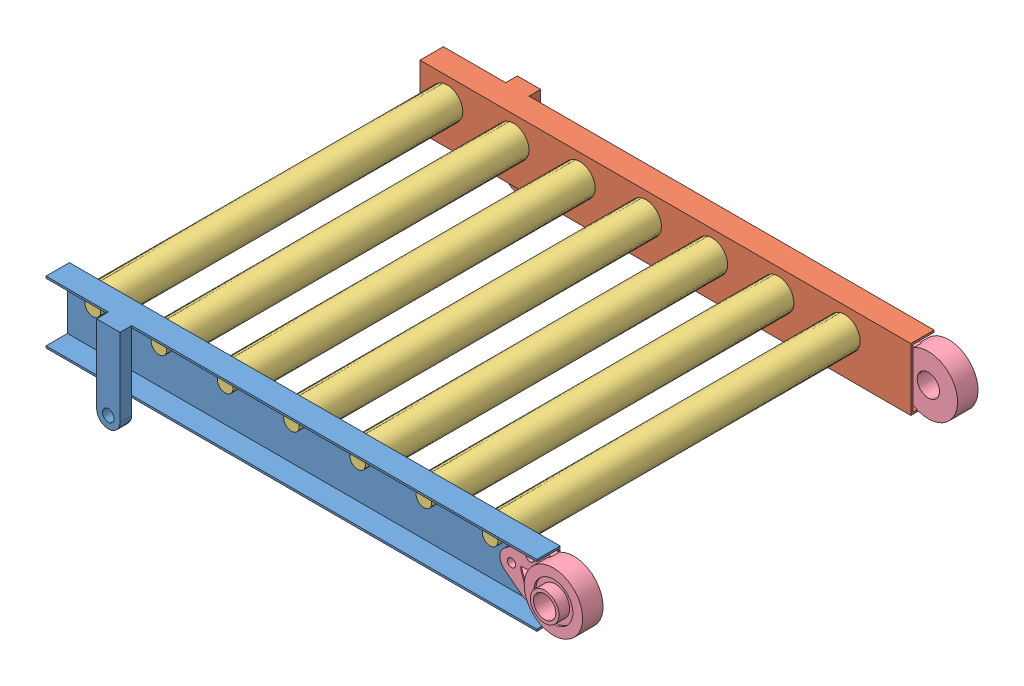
SolidWorks assembly pivot conv.SLDASM, configuration Default (file format 3100). Lengths in mm.
Overall size (873.12 146.05 685.8).
11 component instances, 4 part files, 15 mates.
Components (placement in the parent):
- pivot_rh_rail1-1: pivot_rh_rail1.SLDPRT [Default] at (-825.5 -12.7 285.75) size (800.1 146.05 57.15)
- pivot_lh_rail1-1: pivot_lh_rail1.SLDPRT [Default] at (-825.5 -12.7 -285.75) size (800.1 146.05 57.15)
- conv roller-1: conv roller.SLDPRT [Default] at (-774.7 -44.45 0) size (50.8 50.8 596.9)
- 3bolt flange1-1: 3bolt flange1.SLDPRT [simple] at (0 -60.325 288.925) x (0 -1 0) z (0 0 1) size (95.25 155.58 47.62)
- 3bolt flange1-2: 3bolt flange1.SLDPRT [simple] at (0 -60.325 -288.925) x (0 1 0) z (0 0 -1) size (95.25 155.58 47.62)
- conv roller-8: conv roller.SLDPRT [Default] at (-666.75 -44.45 0) size (50.8 50.8 596.9)
- conv roller-9: conv roller.SLDPRT [Default] at (-558.8 -44.45 0) size (50.8 50.8 596.9)
- conv roller-10: conv roller.SLDPRT [Default] at (-450.85 -44.45 0) size (50.8 50.8 596.9)
- conv roller-11: conv roller.SLDPRT [Default] at (-342.9 -44.45 0) size (50.8 50.8 596.9)
- conv roller-12: conv roller.SLDPRT [Default] at (-234.95 -44.45 0) size (50.8 50.8 596.9)
- conv roller-13: conv roller.SLDPRT [Default] at (-127 -44.45 0) size (50.8 50.8 596.9)
Mates (geometry in assembly coordinates):
- Distance1: distance = 25.4 mm aligned: plane of pivot_rh_rail1-1; plane of assembly
- Distance2: distance = 6.35 mm anti-aligned: plane of pivot_rh_rail1-1; plane of conv roller-1
- Distance3: distance = 12.7 mm aligned: plane of pivot_rh_rail1-1; plane of assembly
- Coincident2: coincident aligned: plane of pivot_rh_rail1-1; plane of pivot_lh_rail1-1
- Coincident3: coincident aligned: plane of pivot_rh_rail1-1; plane of pivot_lh_rail1-1
- Distance6: distance = 6.35 mm anti-aligned: plane of pivot_lh_rail1-1; plane of conv roller-1
- Concentric1: concentric aligned: cylinder of pivot_rh_rail1-1; cylinder of conv roller-1
- Coincident4: coincident aligned: plane of conv roller-1; plane of assembly
- Coincident5: coincident anti-aligned: plane of pivot_rh_rail1-1; plane of 3bolt flange1-1
- Coincident6: coincident aligned: plane of 3bolt flange1-1; plane of assembly
- Distance5: distance = 6.35 mm aligned: plane of pivot_rh_rail1-1; plane of 3bolt flange1-1
- Concentric2: concentric anti-aligned: cylinder of 3bolt flange1-1; cylinder of 3bolt flange1-2
- Coincident7: coincident anti-aligned: plane of pivot_lh_rail1-1; plane of 3bolt flange1-2
- Parallel1: parallel aligned: plane of pivot_lh_rail1-1; plane of 3bolt flange1-2
- Parallel2: parallel aligned: plane of conv roller-1; plane of assembly
